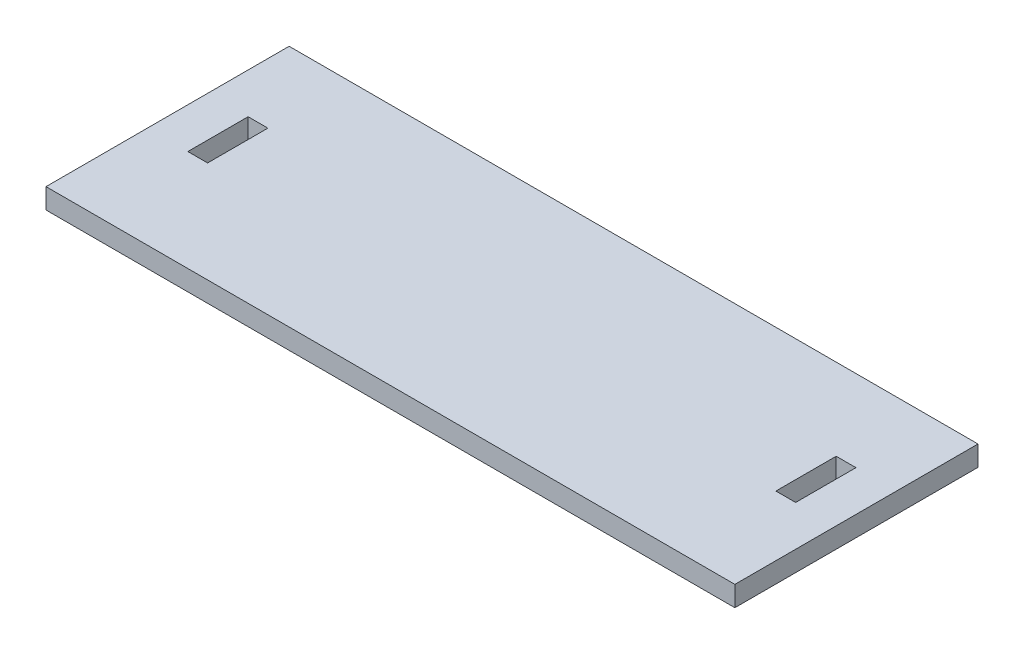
from build123d import *

# Parameters (mm, degrees)
SKETCH1_W           = 340
SKETCH1_H           = 120
SKETCH1_W_2         = 9.76
SKETCH1_H_2         = 29.76
BOSS_EXTRUDE1_DEPTH = 10


with BuildPart() as part:
    # Sketch1 → Boss-Extrude1 (new body)
    with BuildSketch(Plane(origin=(0, 0, 0), x_dir=(1, 0, 0), z_dir=(0, 1, 0))):
        with Locations((101.238398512, -51.78246899)):
            Rectangle(SKETCH1_W, SKETCH1_H)
        with Locations((-43.881601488, -46.90246899)):
            Rectangle(SKETCH1_W_2, SKETCH1_H_2, mode=Mode.SUBTRACT)
        with Locations((246.358398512, -46.90246899)):
            Rectangle(SKETCH1_W_2, SKETCH1_H_2, mode=Mode.SUBTRACT)
    extrude(amount=BOSS_EXTRUDE1_DEPTH)


solid = part.part
